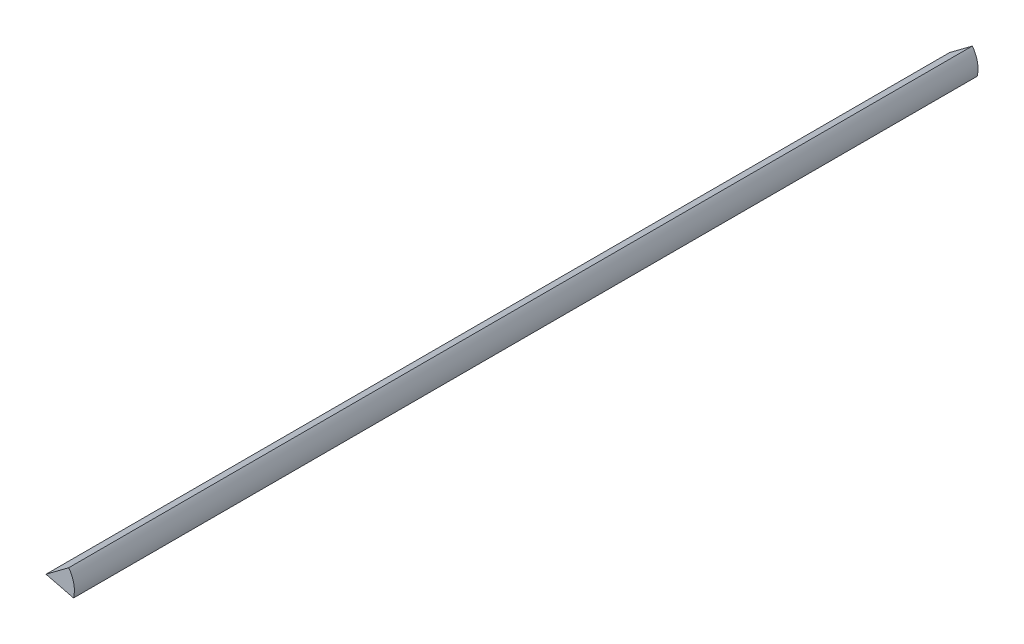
from build123d import *

# Parameters (mm, degrees)
BOSS_EXTRUDE1_DEPTH = 1212.85


with BuildPart() as part:
    # Sketch1 → Boss-Extrude1 (new body)
    with BuildSketch(Plane.XY):
        with BuildLine():
            Line((171.262217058, -2455.741280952), (140.756251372, -2478.566619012))
            Line((140.756251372, -2478.566619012), (177.746009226, -2487.697216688))
            ThreePointArc((177.746009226, -2487.697216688), (178.095421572, -2470.990579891), (171.262217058, -2455.741280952))
        make_face()
    extrude(amount=-BOSS_EXTRUDE1_DEPTH)


solid = part.part
